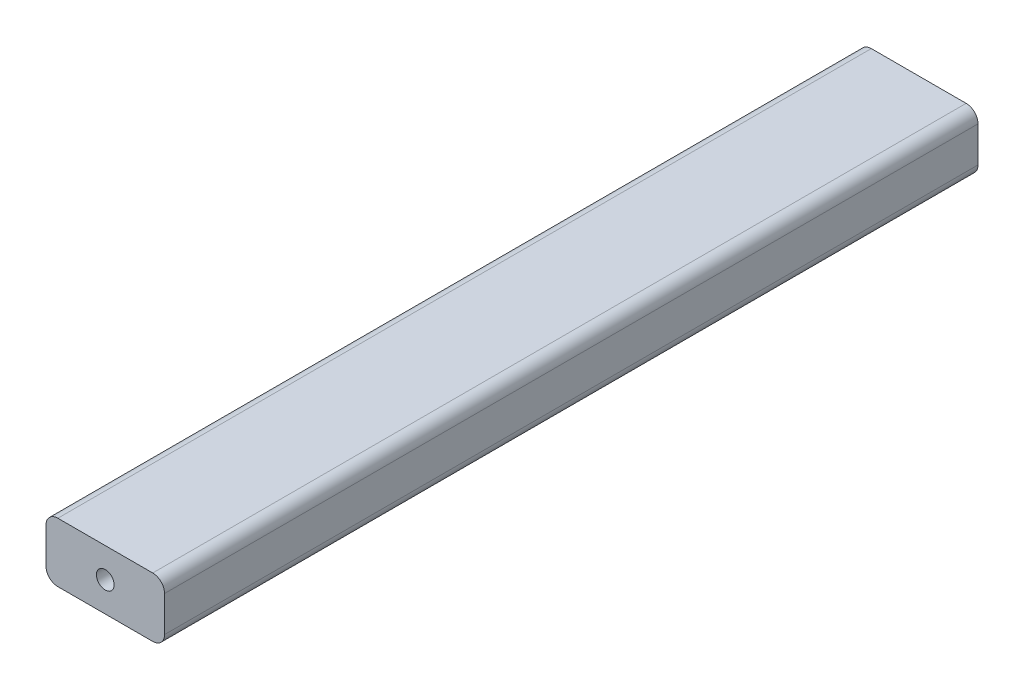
from build123d import *

# Parameters (mm, degrees)
SKETCH1_W           = 25.4
SKETCH1_H           = 12.7
BOSS_EXTRUDE1_DEPTH = 87.1347
FILLET1_R           = 2.54


with BuildPart() as part:
    # Sketch1 → Boss-Extrude1 (new, symmetric)
    with BuildSketch(Plane.XY):
        with Locations((-0.889, 47.0916)):
            Rectangle(SKETCH1_W, SKETCH1_H)
    extrude(amount=BOSS_EXTRUDE1_DEPTH, both=True)

    # Fillet1
    fillet1_edges = [part.edges().sort_by_distance(p)[0] for p in [
        (-13.589, 53.4416, 0),
        (11.811, 53.4416, 0),
        (11.811, 40.7416, 0),
        (-13.589, 40.7416, 0),
    ]]
    fillet(fillet1_edges, radius=FILLET1_R)

    # Sketch3 → 10-24 Tapped Hole1 (revolve, cut)
    with BuildSketch(Plane(origin=(-0.889, 47.0916, 87.1347), x_dir=(0, -1, 0), z_dir=(1, 0, 0))):
        Polygon((0, 0), (0, 16.088724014), (1.89865, 14.9479), (1.89865, 0), align=None)
    f_10_24_tapped_hole1 = revolve(axis=Axis((-0.889, 47.0916, 93.4847), (0, 0, -1)), mode=Mode.SUBTRACT)

    # Mirror1: 10-24 Tapped Hole1 across plane
    add(f_10_24_tapped_hole1.mirror(Plane.XY), mode=Mode.SUBTRACT)


solid = part.part
